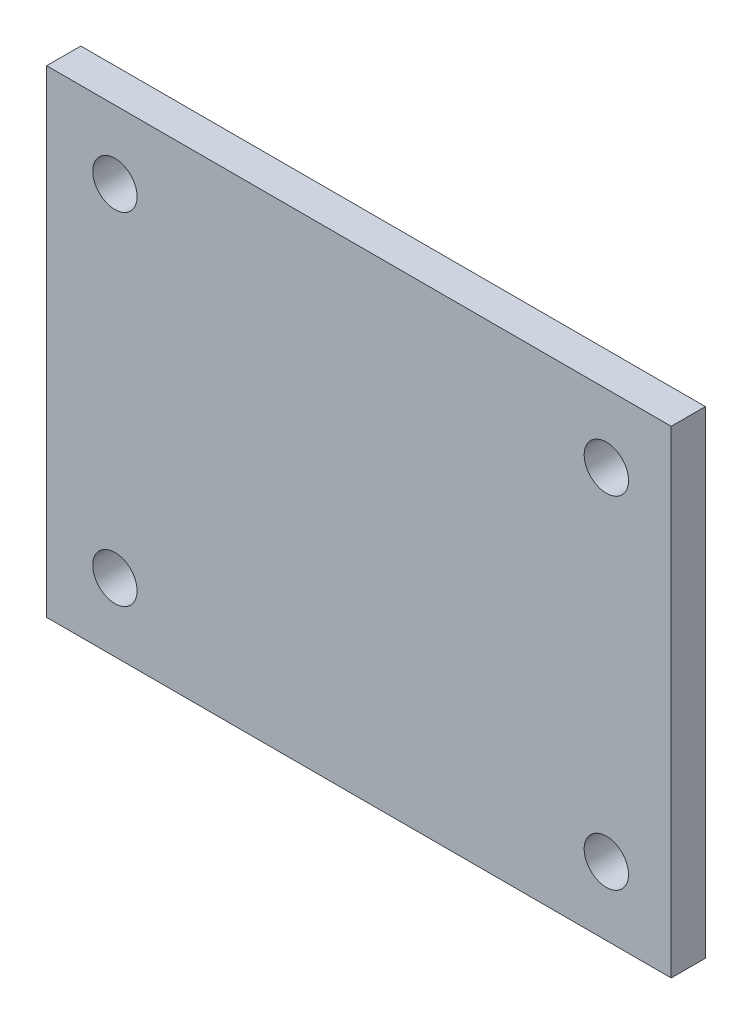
ISO-10303-21;
HEADER;
FILE_DESCRIPTION(('STEP AP214'),'2;1');
FILE_NAME('part.step','',(''),(''),'','','');
FILE_SCHEMA(('AUTOMOTIVE_DESIGN { 1 0 10303 214 1 1 1 1 }'));
ENDSEC;
DATA;
#1=APPLICATION_CONTEXT('core data for automotive mechanical design processes');
#2=APPLICATION_PROTOCOL_DEFINITION('international standard','automotive_design',2000,#1);
#3=PRODUCT_CONTEXT('',#1,'mechanical');
#4=PRODUCT('Part','Part','',(#3));
#5=PRODUCT_RELATED_PRODUCT_CATEGORY('part','',(#4));
#6=PRODUCT_DEFINITION_FORMATION('','',#4);
#7=PRODUCT_DEFINITION_CONTEXT('part definition',#1,'design');
#8=PRODUCT_DEFINITION('design','',#6,#7);
#9=PRODUCT_DEFINITION_SHAPE('','',#8);
#10=(LENGTH_UNIT() NAMED_UNIT(*) SI_UNIT(.MILLI.,.METRE.));
#11=(NAMED_UNIT(*) PLANE_ANGLE_UNIT() SI_UNIT($,.RADIAN.));
#12=(NAMED_UNIT(*) SI_UNIT($,.STERADIAN.) SOLID_ANGLE_UNIT());
#13=UNCERTAINTY_MEASURE_WITH_UNIT(LENGTH_MEASURE(1.E-05),#10,'distance_accuracy_value','');
#14=(GEOMETRIC_REPRESENTATION_CONTEXT(3) GLOBAL_UNCERTAINTY_ASSIGNED_CONTEXT((#13)) GLOBAL_UNIT_ASSIGNED_CONTEXT((#10,
#11,#12)) REPRESENTATION_CONTEXT('',''));
#15=CARTESIAN_POINT('',(0.,0.,0.));
#16=DIRECTION('',(0.,0.,1.));
#17=DIRECTION('',(1.,0.,0.));
#18=AXIS2_PLACEMENT_3D('',#15,#16,#17);
#19=CARTESIAN_POINT('',(0.,0.,10.));
#20=DIRECTION('',(1.,0.,0.));
#21=DIRECTION('',(0.,0.,-1.));
#22=AXIS2_PLACEMENT_3D('',#19,#20,#21);
#23=PLANE('',#22);
#24=DIRECTION('',(0.,-1.,0.));
#25=VECTOR('',#24,1.);
#26=CARTESIAN_POINT('',(0.,0.,0.));
#27=LINE('',#26,#25);
#28=CARTESIAN_POINT('',(0.,140.,0.));
#29=VERTEX_POINT('',#28);
#30=CARTESIAN_POINT('',(0.,0.,0.));
#31=VERTEX_POINT('',#30);
#32=EDGE_CURVE('E71',#29,#31,#27,.T.);
#33=ORIENTED_EDGE('',*,*,#32,.T.);
#34=DIRECTION('',(0.,0.,-1.));
#35=VECTOR('',#34,1.);
#36=CARTESIAN_POINT('',(0.,0.,10.));
#37=LINE('',#36,#35);
#38=CARTESIAN_POINT('',(0.,0.,10.));
#39=VERTEX_POINT('',#38);
#40=EDGE_CURVE('E78',#39,#31,#37,.T.);
#41=ORIENTED_EDGE('',*,*,#40,.F.);
#42=DIRECTION('',(0.,-1.,0.));
#43=VECTOR('',#42,1.);
#44=CARTESIAN_POINT('',(0.,0.,10.));
#45=LINE('',#44,#43);
#46=CARTESIAN_POINT('',(0.,140.,10.));
#47=VERTEX_POINT('',#46);
#48=EDGE_CURVE('E98',#47,#39,#45,.T.);
#49=ORIENTED_EDGE('',*,*,#48,.F.);
#50=DIRECTION('',(0.,0.,-1.));
#51=VECTOR('',#50,1.);
#52=CARTESIAN_POINT('',(0.,140.,10.));
#53=LINE('',#52,#51);
#54=EDGE_CURVE('E87',#47,#29,#53,.T.);
#55=ORIENTED_EDGE('',*,*,#54,.T.);
#56=EDGE_LOOP('',(#33,#41,#49,#55));
#57=FACE_BOUND('',#56,.T.);
#58=ADVANCED_FACE('F24',(#57),#23,.F.);
#59=CARTESIAN_POINT('',(0.,0.,10.));
#60=DIRECTION('',(0.,1.,0.));
#61=DIRECTION('',(0.,0.,1.));
#62=AXIS2_PLACEMENT_3D('',#59,#60,#61);
#63=PLANE('',#62);
#64=DIRECTION('',(1.,0.,0.));
#65=VECTOR('',#64,1.);
#66=CARTESIAN_POINT('',(0.,0.,0.));
#67=LINE('',#66,#65);
#68=CARTESIAN_POINT('',(183.,0.,0.));
#69=VERTEX_POINT('',#68);
#70=EDGE_CURVE('E65',#31,#69,#67,.T.);
#71=ORIENTED_EDGE('',*,*,#70,.T.);
#72=DIRECTION('',(0.,0.,-1.));
#73=VECTOR('',#72,1.);
#74=CARTESIAN_POINT('',(183.,0.,10.));
#75=LINE('',#74,#73);
#76=CARTESIAN_POINT('',(183.,0.,10.));
#77=VERTEX_POINT('',#76);
#78=EDGE_CURVE('E84',#77,#69,#75,.T.);
#79=ORIENTED_EDGE('',*,*,#78,.F.);
#80=DIRECTION('',(1.,0.,0.));
#81=VECTOR('',#80,1.);
#82=CARTESIAN_POINT('',(0.,0.,10.));
#83=LINE('',#82,#81);
#84=EDGE_CURVE('E80',#39,#77,#83,.T.);
#85=ORIENTED_EDGE('',*,*,#84,.F.);
#86=ORIENTED_EDGE('',*,*,#40,.T.);
#87=EDGE_LOOP('',(#71,#79,#85,#86));
#88=FACE_BOUND('',#87,.T.);
#89=ADVANCED_FACE('F79',(#88),#63,.F.);
#90=CARTESIAN_POINT('',(183.,0.,10.));
#91=DIRECTION('',(-1.,0.,0.));
#92=DIRECTION('',(0.,0.,1.));
#93=AXIS2_PLACEMENT_3D('',#90,#91,#92);
#94=PLANE('',#93);
#95=DIRECTION('',(0.,1.,0.));
#96=VECTOR('',#95,1.);
#97=CARTESIAN_POINT('',(183.,0.,0.));
#98=LINE('',#97,#96);
#99=CARTESIAN_POINT('',(183.,140.,0.));
#100=VERTEX_POINT('',#99);
#101=EDGE_CURVE('E72',#69,#100,#98,.T.);
#102=ORIENTED_EDGE('',*,*,#101,.T.);
#103=DIRECTION('',(0.,0.,-1.));
#104=VECTOR('',#103,1.);
#105=CARTESIAN_POINT('',(183.,140.,10.));
#106=LINE('',#105,#104);
#107=CARTESIAN_POINT('',(183.,140.,10.));
#108=VERTEX_POINT('',#107);
#109=EDGE_CURVE('E104',#108,#100,#106,.T.);
#110=ORIENTED_EDGE('',*,*,#109,.F.);
#111=DIRECTION('',(0.,1.,0.));
#112=VECTOR('',#111,1.);
#113=CARTESIAN_POINT('',(183.,0.,10.));
#114=LINE('',#113,#112);
#115=EDGE_CURVE('E44',#77,#108,#114,.T.);
#116=ORIENTED_EDGE('',*,*,#115,.F.);
#117=ORIENTED_EDGE('',*,*,#78,.T.);
#118=EDGE_LOOP('',(#102,#110,#116,#117));
#119=FACE_BOUND('',#118,.T.);
#120=ADVANCED_FACE('F134',(#119),#94,.F.);
#121=CARTESIAN_POINT('',(0.,140.,10.));
#122=DIRECTION('',(0.,-1.,0.));
#123=DIRECTION('',(0.,0.,-1.));
#124=AXIS2_PLACEMENT_3D('',#121,#122,#123);
#125=PLANE('',#124);
#126=DIRECTION('',(-1.,0.,0.));
#127=VECTOR('',#126,1.);
#128=CARTESIAN_POINT('',(0.,140.,0.));
#129=LINE('',#128,#127);
#130=EDGE_CURVE('E96',#100,#29,#129,.T.);
#131=ORIENTED_EDGE('',*,*,#130,.T.);
#132=ORIENTED_EDGE('',*,*,#54,.F.);
#133=DIRECTION('',(-1.,0.,0.));
#134=VECTOR('',#133,1.);
#135=CARTESIAN_POINT('',(0.,140.,10.));
#136=LINE('',#135,#134);
#137=EDGE_CURVE('E39',#108,#47,#136,.T.);
#138=ORIENTED_EDGE('',*,*,#137,.F.);
#139=ORIENTED_EDGE('',*,*,#109,.T.);
#140=EDGE_LOOP('',(#131,#132,#138,#139));
#141=FACE_BOUND('',#140,.T.);
#142=ADVANCED_FACE('F123',(#141),#125,.F.);
#143=CARTESIAN_POINT('',(0.,140.,10.));
#144=DIRECTION('',(0.,0.,-1.));
#145=DIRECTION('',(-1.,0.,0.));
#146=AXIS2_PLACEMENT_3D('',#143,#144,#145);
#147=PLANE('',#146);
#148=CARTESIAN_POINT('',(20.,120.,10.));
#149=DIRECTION('',(0.,0.,1.));
#150=DIRECTION('',(1.,0.,0.));
#151=AXIS2_PLACEMENT_3D('',#148,#149,#150);
#152=CIRCLE('',#151,6.50000000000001);
#153=CARTESIAN_POINT('',(26.5,120.,10.));
#154=VERTEX_POINT('',#153);
#155=EDGE_CURVE('E167',#154,#154,#152,.T.);
#156=ORIENTED_EDGE('',*,*,#155,.F.);
#157=EDGE_LOOP('',(#156));
#158=FACE_BOUND('',#157,.T.);
#159=CARTESIAN_POINT('',(20.,20.,10.));
#160=DIRECTION('',(0.,0.,1.));
#161=DIRECTION('',(1.,0.,0.));
#162=AXIS2_PLACEMENT_3D('',#159,#160,#161);
#163=CIRCLE('',#162,6.50000000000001);
#164=CARTESIAN_POINT('',(26.5,20.,10.));
#165=VERTEX_POINT('',#164);
#166=EDGE_CURVE('E91',#165,#165,#163,.T.);
#167=ORIENTED_EDGE('',*,*,#166,.F.);
#168=EDGE_LOOP('',(#167));
#169=FACE_BOUND('',#168,.T.);
#170=ORIENTED_EDGE('',*,*,#48,.T.);
#171=ORIENTED_EDGE('',*,*,#84,.T.);
#172=ORIENTED_EDGE('',*,*,#115,.T.);
#173=ORIENTED_EDGE('',*,*,#137,.T.);
#174=EDGE_LOOP('',(#170,#171,#172,#173));
#175=FACE_BOUND('',#174,.T.);
#176=CARTESIAN_POINT('',(164.,20.,10.));
#177=DIRECTION('',(0.,0.,1.));
#178=DIRECTION('',(1.,0.,0.));
#179=AXIS2_PLACEMENT_3D('',#176,#177,#178);
#180=CIRCLE('',#179,6.50000000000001);
#181=CARTESIAN_POINT('',(170.5,20.,10.));
#182=VERTEX_POINT('',#181);
#183=EDGE_CURVE('E110',#182,#182,#180,.T.);
#184=ORIENTED_EDGE('',*,*,#183,.F.);
#185=EDGE_LOOP('',(#184));
#186=FACE_BOUND('',#185,.T.);
#187=CARTESIAN_POINT('',(164.,120.,10.));
#188=DIRECTION('',(0.,0.,1.));
#189=DIRECTION('',(1.,0.,0.));
#190=AXIS2_PLACEMENT_3D('',#187,#188,#189);
#191=CIRCLE('',#190,6.50000000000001);
#192=CARTESIAN_POINT('',(170.5,120.,10.));
#193=VERTEX_POINT('',#192);
#194=EDGE_CURVE('E11',#193,#193,#191,.T.);
#195=ORIENTED_EDGE('',*,*,#194,.F.);
#196=EDGE_LOOP('',(#195));
#197=FACE_BOUND('',#196,.T.);
#198=ADVANCED_FACE('F121',(#158,#169,#175,#186,#197),#147,.F.);
#199=CARTESIAN_POINT('',(0.,140.,0.));
#200=DIRECTION('',(0.,0.,-1.));
#201=DIRECTION('',(-1.,0.,0.));
#202=AXIS2_PLACEMENT_3D('',#199,#200,#201);
#203=PLANE('',#202);
#204=CARTESIAN_POINT('',(20.,120.,0.));
#205=DIRECTION('',(0.,0.,1.));
#206=DIRECTION('',(1.,0.,0.));
#207=AXIS2_PLACEMENT_3D('',#204,#205,#206);
#208=CIRCLE('',#207,6.50000000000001);
#209=CARTESIAN_POINT('',(26.5,120.,0.));
#210=VERTEX_POINT('',#209);
#211=EDGE_CURVE('E165',#210,#210,#208,.T.);
#212=ORIENTED_EDGE('',*,*,#211,.T.);
#213=EDGE_LOOP('',(#212));
#214=FACE_BOUND('',#213,.T.);
#215=CARTESIAN_POINT('',(20.,20.,0.));
#216=DIRECTION('',(0.,0.,1.));
#217=DIRECTION('',(1.,0.,0.));
#218=AXIS2_PLACEMENT_3D('',#215,#216,#217);
#219=CIRCLE('',#218,6.50000000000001);
#220=CARTESIAN_POINT('',(26.5,20.,0.));
#221=VERTEX_POINT('',#220);
#222=EDGE_CURVE('E88',#221,#221,#219,.T.);
#223=ORIENTED_EDGE('',*,*,#222,.T.);
#224=EDGE_LOOP('',(#223));
#225=FACE_BOUND('',#224,.T.);
#226=ORIENTED_EDGE('',*,*,#32,.F.);
#227=ORIENTED_EDGE('',*,*,#130,.F.);
#228=ORIENTED_EDGE('',*,*,#101,.F.);
#229=ORIENTED_EDGE('',*,*,#70,.F.);
#230=EDGE_LOOP('',(#226,#227,#228,#229));
#231=FACE_BOUND('',#230,.T.);
#232=CARTESIAN_POINT('',(164.,20.,0.));
#233=DIRECTION('',(0.,0.,1.));
#234=DIRECTION('',(1.,0.,0.));
#235=AXIS2_PLACEMENT_3D('',#232,#233,#234);
#236=CIRCLE('',#235,6.50000000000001);
#237=CARTESIAN_POINT('',(170.5,20.,0.));
#238=VERTEX_POINT('',#237);
#239=EDGE_CURVE('E83',#238,#238,#236,.T.);
#240=ORIENTED_EDGE('',*,*,#239,.T.);
#241=EDGE_LOOP('',(#240));
#242=FACE_BOUND('',#241,.T.);
#243=CARTESIAN_POINT('',(164.,120.,0.));
#244=DIRECTION('',(0.,0.,1.));
#245=DIRECTION('',(1.,0.,0.));
#246=AXIS2_PLACEMENT_3D('',#243,#244,#245);
#247=CIRCLE('',#246,6.50000000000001);
#248=CARTESIAN_POINT('',(170.5,120.,0.));
#249=VERTEX_POINT('',#248);
#250=EDGE_CURVE('E32',#249,#249,#247,.T.);
#251=ORIENTED_EDGE('',*,*,#250,.T.);
#252=EDGE_LOOP('',(#251));
#253=FACE_BOUND('',#252,.T.);
#254=ADVANCED_FACE('F67',(#214,#225,#231,#242,#253),#203,.T.);
#255=CARTESIAN_POINT('',(20.,20.,0.));
#256=DIRECTION('',(0.,0.,1.));
#257=DIRECTION('',(1.,0.,0.));
#258=AXIS2_PLACEMENT_3D('',#255,#256,#257);
#259=CYLINDRICAL_SURFACE('',#258,6.50000000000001);
#260=ORIENTED_EDGE('',*,*,#222,.F.);
#261=EDGE_LOOP('',(#260));
#262=FACE_BOUND('',#261,.T.);
#263=ORIENTED_EDGE('',*,*,#166,.T.);
#264=EDGE_LOOP('',(#263));
#265=FACE_BOUND('',#264,.T.);
#266=ADVANCED_FACE('F130',(#262,#265),#259,.F.);
#267=CARTESIAN_POINT('',(20.,120.,0.));
#268=DIRECTION('',(0.,0.,1.));
#269=DIRECTION('',(1.,0.,0.));
#270=AXIS2_PLACEMENT_3D('',#267,#268,#269);
#271=CYLINDRICAL_SURFACE('',#270,6.50000000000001);
#272=ORIENTED_EDGE('',*,*,#211,.F.);
#273=EDGE_LOOP('',(#272));
#274=FACE_BOUND('',#273,.T.);
#275=ORIENTED_EDGE('',*,*,#155,.T.);
#276=EDGE_LOOP('',(#275));
#277=FACE_BOUND('',#276,.T.);
#278=ADVANCED_FACE('F147',(#274,#277),#271,.F.);
#279=CARTESIAN_POINT('',(164.,20.,0.));
#280=DIRECTION('',(0.,0.,1.));
#281=DIRECTION('',(1.,0.,0.));
#282=AXIS2_PLACEMENT_3D('',#279,#280,#281);
#283=CYLINDRICAL_SURFACE('',#282,6.50000000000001);
#284=ORIENTED_EDGE('',*,*,#239,.F.);
#285=EDGE_LOOP('',(#284));
#286=FACE_BOUND('',#285,.T.);
#287=ORIENTED_EDGE('',*,*,#183,.T.);
#288=EDGE_LOOP('',(#287));
#289=FACE_BOUND('',#288,.T.);
#290=ADVANCED_FACE('F118',(#286,#289),#283,.F.);
#291=CARTESIAN_POINT('',(164.,120.,0.));
#292=DIRECTION('',(0.,0.,1.));
#293=DIRECTION('',(1.,0.,0.));
#294=AXIS2_PLACEMENT_3D('',#291,#292,#293);
#295=CYLINDRICAL_SURFACE('',#294,6.50000000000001);
#296=ORIENTED_EDGE('',*,*,#250,.F.);
#297=EDGE_LOOP('',(#296));
#298=FACE_BOUND('',#297,.T.);
#299=ORIENTED_EDGE('',*,*,#194,.T.);
#300=EDGE_LOOP('',(#299));
#301=FACE_BOUND('',#300,.T.);
#302=ADVANCED_FACE('F26',(#298,#301),#295,.F.);
#303=CLOSED_SHELL('',(#58,#89,#120,#142,#198,#254,#266,#278,#290,#302));
#304=MANIFOLD_SOLID_BREP('B2',#303);
#305=ADVANCED_BREP_SHAPE_REPRESENTATION('',(#18,#304),#14);
#306=SHAPE_DEFINITION_REPRESENTATION(#9,#305);
ENDSEC;
END-ISO-10303-21;
